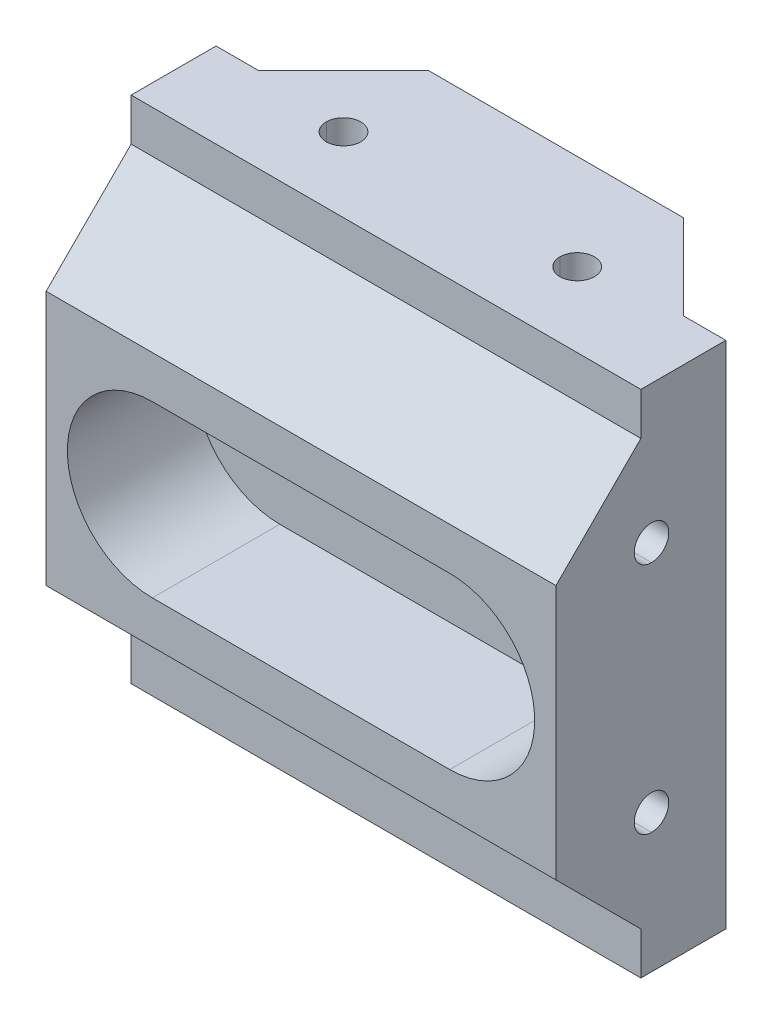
ISO-10303-21;
HEADER;
FILE_DESCRIPTION(('STEP AP214'),'2;1');
FILE_NAME('part.step','',(''),(''),'','','');
FILE_SCHEMA(('AUTOMOTIVE_DESIGN { 1 0 10303 214 1 1 1 1 }'));
ENDSEC;
DATA;
#1=APPLICATION_CONTEXT('core data for automotive mechanical design processes');
#2=APPLICATION_PROTOCOL_DEFINITION('international standard','automotive_design',2000,#1);
#3=PRODUCT_CONTEXT('',#1,'mechanical');
#4=PRODUCT('Part','Part','',(#3));
#5=PRODUCT_RELATED_PRODUCT_CATEGORY('part','',(#4));
#6=PRODUCT_DEFINITION_FORMATION('','',#4);
#7=PRODUCT_DEFINITION_CONTEXT('part definition',#1,'design');
#8=PRODUCT_DEFINITION('design','',#6,#7);
#9=PRODUCT_DEFINITION_SHAPE('','',#8);
#10=(LENGTH_UNIT() NAMED_UNIT(*) SI_UNIT(.MILLI.,.METRE.));
#11=(NAMED_UNIT(*) PLANE_ANGLE_UNIT() SI_UNIT($,.RADIAN.));
#12=(NAMED_UNIT(*) SI_UNIT($,.STERADIAN.) SOLID_ANGLE_UNIT());
#13=UNCERTAINTY_MEASURE_WITH_UNIT(LENGTH_MEASURE(1.E-05),#10,'distance_accuracy_value','');
#14=(GEOMETRIC_REPRESENTATION_CONTEXT(3) GLOBAL_UNCERTAINTY_ASSIGNED_CONTEXT((#13)) GLOBAL_UNIT_ASSIGNED_CONTEXT((#10,
#11,#12)) REPRESENTATION_CONTEXT('',''));
#15=CARTESIAN_POINT('',(0.,0.,0.));
#16=DIRECTION('',(0.,0.,1.));
#17=DIRECTION('',(1.,0.,0.));
#18=AXIS2_PLACEMENT_3D('',#15,#16,#17);
#19=CARTESIAN_POINT('',(0.,0.,-7.21911419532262E-13));
#20=DIRECTION('',(0.,0.,-1.));
#21=DIRECTION('',(-1.,0.,0.));
#22=AXIS2_PLACEMENT_3D('',#19,#20,#21);
#23=PLANE('',#22);
#24=DIRECTION('',(1.,0.,0.));
#25=VECTOR('',#24,1.);
#26=CARTESIAN_POINT('',(-22.225,12.7,-7.21911419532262E-13));
#27=LINE('',#26,#25);
#28=CARTESIAN_POINT('',(22.225,12.7,-7.21911419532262E-13));
#29=VERTEX_POINT('',#28);
#30=CARTESIAN_POINT('',(-22.225,12.7,-7.21911419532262E-13));
#31=VERTEX_POINT('',#30);
#32=EDGE_CURVE('E174',#29,#31,#27,.F.);
#33=ORIENTED_EDGE('',*,*,#32,.T.);
#34=CARTESIAN_POINT('',(-22.225,0.,-7.21911419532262E-13));
#35=DIRECTION('',(0.,0.,1.));
#36=DIRECTION('',(1.,0.,0.));
#37=AXIS2_PLACEMENT_3D('',#34,#35,#36);
#38=CIRCLE('',#37,12.7);
#39=CARTESIAN_POINT('',(-22.225,-12.6999999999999,-7.21911419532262E-13));
#40=VERTEX_POINT('',#39);
#41=EDGE_CURVE('E19',#31,#40,#38,.T.);
#42=ORIENTED_EDGE('',*,*,#41,.T.);
#43=DIRECTION('',(1.,0.,0.));
#44=VECTOR('',#43,1.);
#45=CARTESIAN_POINT('',(22.225,-12.7,-7.21911419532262E-13));
#46=LINE('',#45,#44);
#47=CARTESIAN_POINT('',(22.225,-12.7,-7.21911419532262E-13));
#48=VERTEX_POINT('',#47);
#49=EDGE_CURVE('E177',#40,#48,#46,.T.);
#50=ORIENTED_EDGE('',*,*,#49,.T.);
#51=CARTESIAN_POINT('',(22.225,0.,-7.21911419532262E-13));
#52=DIRECTION('',(0.,0.,1.));
#53=DIRECTION('',(1.,0.,0.));
#54=AXIS2_PLACEMENT_3D('',#51,#52,#53);
#55=CIRCLE('',#54,12.7);
#56=EDGE_CURVE('E258',#48,#29,#55,.T.);
#57=ORIENTED_EDGE('',*,*,#56,.T.);
#58=EDGE_LOOP('',(#33,#42,#50,#57));
#59=FACE_BOUND('',#58,.T.);
#60=ADVANCED_FACE('F16',(#59),#23,.F.);
#61=CARTESIAN_POINT('',(25.4,-17.4624999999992,4.76250000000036));
#62=DIRECTION('',(-1.,0.,0.));
#63=DIRECTION('',(0.,0.,1.));
#64=AXIS2_PLACEMENT_3D('',#61,#62,#63);
#65=PLANE('',#64);
#66=CARTESIAN_POINT('',(25.4,-17.4624999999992,4.76250000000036));
#67=DIRECTION('',(1.,0.,0.));
#68=DIRECTION('',(0.,0.,-1.));
#69=AXIS2_PLACEMENT_3D('',#66,#67,#68);
#70=CIRCLE('',#69,2.5796875);
#71=CARTESIAN_POINT('',(25.4,-14.8828124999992,4.76250000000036));
#72=VERTEX_POINT('',#71);
#73=CARTESIAN_POINT('',(25.4,-20.0421874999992,4.76250000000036));
#74=VERTEX_POINT('',#73);
#75=EDGE_CURVE('E253',#72,#74,#70,.T.);
#76=ORIENTED_EDGE('',*,*,#75,.T.);
#77=CARTESIAN_POINT('',(25.4,-17.4624999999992,4.76250000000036));
#78=DIRECTION('',(1.,0.,0.));
#79=DIRECTION('',(0.,0.,-1.));
#80=AXIS2_PLACEMENT_3D('',#77,#78,#79);
#81=CIRCLE('',#80,2.5796875);
#82=EDGE_CURVE('E256',#74,#72,#81,.T.);
#83=ORIENTED_EDGE('',*,*,#82,.T.);
#84=EDGE_LOOP('',(#76,#83));
#85=FACE_BOUND('',#84,.T.);
#86=ADVANCED_FACE('F495',(#85),#65,.F.);
#87=CARTESIAN_POINT('',(25.4,17.4625000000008,4.76250000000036));
#88=DIRECTION('',(-1.,0.,0.));
#89=DIRECTION('',(0.,0.,1.));
#90=AXIS2_PLACEMENT_3D('',#87,#88,#89);
#91=PLANE('',#90);
#92=CARTESIAN_POINT('',(25.4,17.4625000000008,4.76250000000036));
#93=DIRECTION('',(-1.,0.,0.));
#94=DIRECTION('',(0.,0.,1.));
#95=AXIS2_PLACEMENT_3D('',#92,#93,#94);
#96=CIRCLE('',#95,2.5796875);
#97=CARTESIAN_POINT('',(25.4,20.0421875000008,4.76250000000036));
#98=VERTEX_POINT('',#97);
#99=CARTESIAN_POINT('',(25.4,14.8828125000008,4.76250000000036));
#100=VERTEX_POINT('',#99);
#101=EDGE_CURVE('E250',#98,#100,#96,.F.);
#102=ORIENTED_EDGE('',*,*,#101,.T.);
#103=CARTESIAN_POINT('',(25.4,17.4625000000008,4.76250000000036));
#104=DIRECTION('',(-1.,0.,0.));
#105=DIRECTION('',(0.,0.,1.));
#106=AXIS2_PLACEMENT_3D('',#103,#104,#105);
#107=CIRCLE('',#106,2.5796875);
#108=EDGE_CURVE('E247',#100,#98,#107,.F.);
#109=ORIENTED_EDGE('',*,*,#108,.T.);
#110=EDGE_LOOP('',(#102,#109));
#111=FACE_BOUND('',#110,.T.);
#112=ADVANCED_FACE('F493',(#111),#91,.F.);
#113=CARTESIAN_POINT('',(22.225,-12.7,-7.21911419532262E-13));
#114=DIRECTION('',(0.,-1.,0.));
#115=DIRECTION('',(1.,0.,0.));
#116=AXIS2_PLACEMENT_3D('',#113,#114,#115);
#117=PLANE('',#116);
#118=DIRECTION('',(0.,0.,1.));
#119=VECTOR('',#118,1.);
#120=CARTESIAN_POINT('',(22.225,-12.7,-7.21911419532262E-13));
#121=LINE('',#120,#119);
#122=CARTESIAN_POINT('',(22.225,-12.7,19.05));
#123=VERTEX_POINT('',#122);
#124=EDGE_CURVE('E187',#123,#48,#121,.F.);
#125=ORIENTED_EDGE('',*,*,#124,.T.);
#126=ORIENTED_EDGE('',*,*,#49,.F.);
#127=DIRECTION('',(0.,0.,1.));
#128=VECTOR('',#127,1.);
#129=CARTESIAN_POINT('',(-22.225,-12.7,-7.21911419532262E-13));
#130=LINE('',#129,#128);
#131=CARTESIAN_POINT('',(-22.225,-12.7,19.05));
#132=VERTEX_POINT('',#131);
#133=EDGE_CURVE('E182',#40,#132,#130,.T.);
#134=ORIENTED_EDGE('',*,*,#133,.T.);
#135=DIRECTION('',(1.,0.,0.));
#136=VECTOR('',#135,1.);
#137=CARTESIAN_POINT('',(-38.1,-12.7,19.05));
#138=LINE('',#137,#136);
#139=EDGE_CURVE('E246',#123,#132,#138,.F.);
#140=ORIENTED_EDGE('',*,*,#139,.F.);
#141=EDGE_LOOP('',(#125,#126,#134,#140));
#142=FACE_BOUND('',#141,.T.);
#143=ADVANCED_FACE('F184',(#142),#117,.F.);
#144=CARTESIAN_POINT('',(-22.225,0.,-7.21911419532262E-13));
#145=DIRECTION('',(0.,0.,1.));
#146=DIRECTION('',(1.,0.,0.));
#147=AXIS2_PLACEMENT_3D('',#144,#145,#146);
#148=CYLINDRICAL_SURFACE('',#147,12.7);
#149=ORIENTED_EDGE('',*,*,#133,.F.);
#150=ORIENTED_EDGE('',*,*,#41,.F.);
#151=DIRECTION('',(0.,0.,1.));
#152=VECTOR('',#151,1.);
#153=CARTESIAN_POINT('',(-22.225,12.7,-7.21911419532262E-13));
#154=LINE('',#153,#152);
#155=CARTESIAN_POINT('',(-22.225,12.7,19.05));
#156=VERTEX_POINT('',#155);
#157=EDGE_CURVE('E195',#31,#156,#154,.T.);
#158=ORIENTED_EDGE('',*,*,#157,.T.);
#159=CARTESIAN_POINT('',(-22.225,0.,19.05));
#160=DIRECTION('',(0.,0.,1.));
#161=DIRECTION('',(1.,0.,0.));
#162=AXIS2_PLACEMENT_3D('',#159,#160,#161);
#163=CIRCLE('',#162,12.7);
#164=EDGE_CURVE('E192',#132,#156,#163,.F.);
#165=ORIENTED_EDGE('',*,*,#164,.F.);
#166=EDGE_LOOP('',(#149,#150,#158,#165));
#167=FACE_BOUND('',#166,.T.);
#168=ADVANCED_FACE('F190',(#167),#148,.F.);
#169=CARTESIAN_POINT('',(-22.225,12.7,-7.21911419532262E-13));
#170=DIRECTION('',(0.,1.,0.));
#171=DIRECTION('',(0.,0.,1.));
#172=AXIS2_PLACEMENT_3D('',#169,#170,#171);
#173=PLANE('',#172);
#174=ORIENTED_EDGE('',*,*,#157,.F.);
#175=ORIENTED_EDGE('',*,*,#32,.F.);
#176=DIRECTION('',(0.,0.,1.));
#177=VECTOR('',#176,1.);
#178=CARTESIAN_POINT('',(22.225,12.7,-7.21911419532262E-13));
#179=LINE('',#178,#177);
#180=CARTESIAN_POINT('',(22.225,12.7,19.05));
#181=VERTEX_POINT('',#180);
#182=EDGE_CURVE('E257',#29,#181,#179,.T.);
#183=ORIENTED_EDGE('',*,*,#182,.T.);
#184=DIRECTION('',(1.,0.,0.));
#185=VECTOR('',#184,1.);
#186=CARTESIAN_POINT('',(-38.1,12.7,19.05));
#187=LINE('',#186,#185);
#188=EDGE_CURVE('E244',#156,#181,#187,.T.);
#189=ORIENTED_EDGE('',*,*,#188,.F.);
#190=EDGE_LOOP('',(#174,#175,#183,#189));
#191=FACE_BOUND('',#190,.T.);
#192=ADVANCED_FACE('F481',(#191),#173,.F.);
#193=CARTESIAN_POINT('',(22.225,0.,-7.21911419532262E-13));
#194=DIRECTION('',(0.,0.,1.));
#195=DIRECTION('',(1.,0.,0.));
#196=AXIS2_PLACEMENT_3D('',#193,#194,#195);
#197=CYLINDRICAL_SURFACE('',#196,12.7);
#198=ORIENTED_EDGE('',*,*,#182,.F.);
#199=ORIENTED_EDGE('',*,*,#56,.F.);
#200=ORIENTED_EDGE('',*,*,#124,.F.);
#201=CARTESIAN_POINT('',(22.225,0.,19.05));
#202=DIRECTION('',(0.,0.,1.));
#203=DIRECTION('',(1.,0.,0.));
#204=AXIS2_PLACEMENT_3D('',#201,#202,#203);
#205=CIRCLE('',#204,12.7);
#206=EDGE_CURVE('E240',#181,#123,#205,.F.);
#207=ORIENTED_EDGE('',*,*,#206,.F.);
#208=EDGE_LOOP('',(#198,#199,#200,#207));
#209=FACE_BOUND('',#208,.T.);
#210=ADVANCED_FACE('F472',(#209),#197,.F.);
#211=CARTESIAN_POINT('',(17.4625,25.4,-4.76250000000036));
#212=DIRECTION('',(0.,-1.,0.));
#213=DIRECTION('',(0.,0.,-1.));
#214=AXIS2_PLACEMENT_3D('',#211,#212,#213);
#215=PLANE('',#214);
#216=CARTESIAN_POINT('',(17.4625,25.4,-4.76250000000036));
#217=DIRECTION('',(0.,1.,0.));
#218=DIRECTION('',(0.,0.,1.));
#219=AXIS2_PLACEMENT_3D('',#216,#217,#218);
#220=CIRCLE('',#219,2.5796875);
#221=CARTESIAN_POINT('',(14.8828125,25.4,-4.76250000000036));
#222=VERTEX_POINT('',#221);
#223=CARTESIAN_POINT('',(20.0421875,25.4,-4.76250000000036));
#224=VERTEX_POINT('',#223);
#225=EDGE_CURVE('E234',#222,#224,#220,.T.);
#226=ORIENTED_EDGE('',*,*,#225,.T.);
#227=CARTESIAN_POINT('',(17.4625,25.4,-4.76250000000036));
#228=DIRECTION('',(0.,1.,0.));
#229=DIRECTION('',(0.,0.,1.));
#230=AXIS2_PLACEMENT_3D('',#227,#228,#229);
#231=CIRCLE('',#230,2.5796875);
#232=EDGE_CURVE('E237',#224,#222,#231,.T.);
#233=ORIENTED_EDGE('',*,*,#232,.T.);
#234=EDGE_LOOP('',(#226,#233));
#235=FACE_BOUND('',#234,.T.);
#236=ADVANCED_FACE('F469',(#235),#215,.F.);
#237=CARTESIAN_POINT('',(-17.4625,25.4,-4.76250000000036));
#238=DIRECTION('',(0.,-1.,0.));
#239=DIRECTION('',(0.,0.,-1.));
#240=AXIS2_PLACEMENT_3D('',#237,#238,#239);
#241=PLANE('',#240);
#242=CARTESIAN_POINT('',(-17.4625,25.4,-4.76250000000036));
#243=DIRECTION('',(0.,1.,0.));
#244=DIRECTION('',(0.,0.,1.));
#245=AXIS2_PLACEMENT_3D('',#242,#243,#244);
#246=CIRCLE('',#245,2.5796875);
#247=CARTESIAN_POINT('',(-20.0421875,25.4,-4.76250000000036));
#248=VERTEX_POINT('',#247);
#249=CARTESIAN_POINT('',(-14.8828125,25.4,-4.76250000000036));
#250=VERTEX_POINT('',#249);
#251=EDGE_CURVE('E228',#248,#250,#246,.T.);
#252=ORIENTED_EDGE('',*,*,#251,.T.);
#253=CARTESIAN_POINT('',(-17.4625,25.4,-4.76250000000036));
#254=DIRECTION('',(0.,1.,0.));
#255=DIRECTION('',(0.,0.,1.));
#256=AXIS2_PLACEMENT_3D('',#253,#254,#255);
#257=CIRCLE('',#256,2.5796875);
#258=EDGE_CURVE('E231',#250,#248,#257,.T.);
#259=ORIENTED_EDGE('',*,*,#258,.T.);
#260=EDGE_LOOP('',(#252,#259));
#261=FACE_BOUND('',#260,.T.);
#262=ADVANCED_FACE('F471',(#261),#241,.F.);
#263=CARTESIAN_POINT('',(31.75,-17.4624999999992,4.76250000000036));
#264=DIRECTION('',(1.,0.,0.));
#265=DIRECTION('',(0.,0.,-1.));
#266=AXIS2_PLACEMENT_3D('',#263,#264,#265);
#267=CYLINDRICAL_SURFACE('',#266,2.5796875);
#268=ORIENTED_EDGE('',*,*,#82,.F.);
#269=DIRECTION('',(1.,0.,0.));
#270=VECTOR('',#269,1.);
#271=CARTESIAN_POINT('',(31.75,-20.0421874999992,4.76250000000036));
#272=LINE('',#271,#270);
#273=CARTESIAN_POINT('',(38.1,-20.0421874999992,4.76250000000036));
#274=VERTEX_POINT('',#273);
#275=EDGE_CURVE('E255',#74,#274,#272,.T.);
#276=ORIENTED_EDGE('',*,*,#275,.T.);
#277=CARTESIAN_POINT('',(38.1,-17.4624999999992,4.76250000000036));
#278=DIRECTION('',(1.,0.,0.));
#279=DIRECTION('',(0.,0.,-1.));
#280=AXIS2_PLACEMENT_3D('',#277,#278,#279);
#281=CIRCLE('',#280,2.5796875);
#282=CARTESIAN_POINT('',(38.1,-14.8828124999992,4.76250000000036));
#283=VERTEX_POINT('',#282);
#284=EDGE_CURVE('E224',#283,#274,#281,.F.);
#285=ORIENTED_EDGE('',*,*,#284,.F.);
#286=DIRECTION('',(1.,0.,0.));
#287=VECTOR('',#286,1.);
#288=CARTESIAN_POINT('',(31.75,-14.8828124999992,4.76250000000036));
#289=LINE('',#288,#287);
#290=EDGE_CURVE('E252',#283,#72,#289,.F.);
#291=ORIENTED_EDGE('',*,*,#290,.T.);
#292=EDGE_LOOP('',(#268,#276,#285,#291));
#293=FACE_BOUND('',#292,.T.);
#294=ADVANCED_FACE('F478',(#293),#267,.F.);
#295=CARTESIAN_POINT('',(31.75,-17.4624999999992,4.76250000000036));
#296=DIRECTION('',(1.,0.,0.));
#297=DIRECTION('',(0.,0.,-1.));
#298=AXIS2_PLACEMENT_3D('',#295,#296,#297);
#299=CYLINDRICAL_SURFACE('',#298,2.5796875);
#300=CARTESIAN_POINT('',(38.1,-17.4624999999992,4.76250000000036));
#301=DIRECTION('',(1.,0.,0.));
#302=DIRECTION('',(0.,0.,-1.));
#303=AXIS2_PLACEMENT_3D('',#300,#301,#302);
#304=CIRCLE('',#303,2.5796875);
#305=EDGE_CURVE('E221',#274,#283,#304,.F.);
#306=ORIENTED_EDGE('',*,*,#305,.F.);
#307=ORIENTED_EDGE('',*,*,#275,.F.);
#308=ORIENTED_EDGE('',*,*,#75,.F.);
#309=ORIENTED_EDGE('',*,*,#290,.F.);
#310=EDGE_LOOP('',(#306,#307,#308,#309));
#311=FACE_BOUND('',#310,.T.);
#312=ADVANCED_FACE('F509',(#311),#299,.F.);
#313=CARTESIAN_POINT('',(31.75,17.4625000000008,4.76250000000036));
#314=DIRECTION('',(-1.,0.,0.));
#315=DIRECTION('',(0.,0.,1.));
#316=AXIS2_PLACEMENT_3D('',#313,#314,#315);
#317=CYLINDRICAL_SURFACE('',#316,2.5796875);
#318=ORIENTED_EDGE('',*,*,#101,.F.);
#319=DIRECTION('',(-1.,0.,0.));
#320=VECTOR('',#319,1.);
#321=CARTESIAN_POINT('',(31.75,20.0421875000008,4.76250000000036));
#322=LINE('',#321,#320);
#323=CARTESIAN_POINT('',(38.1,20.0421875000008,4.76250000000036));
#324=VERTEX_POINT('',#323);
#325=EDGE_CURVE('E249',#98,#324,#322,.F.);
#326=ORIENTED_EDGE('',*,*,#325,.T.);
#327=CARTESIAN_POINT('',(38.1,17.4625000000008,4.76250000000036));
#328=DIRECTION('',(-1.,0.,0.));
#329=DIRECTION('',(0.,0.,1.));
#330=AXIS2_PLACEMENT_3D('',#327,#328,#329);
#331=CIRCLE('',#330,2.5796875);
#332=CARTESIAN_POINT('',(38.1,14.8828125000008,4.76250000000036));
#333=VERTEX_POINT('',#332);
#334=EDGE_CURVE('E218',#333,#324,#331,.T.);
#335=ORIENTED_EDGE('',*,*,#334,.F.);
#336=DIRECTION('',(-1.,0.,0.));
#337=VECTOR('',#336,1.);
#338=CARTESIAN_POINT('',(31.75,14.8828125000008,4.76250000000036));
#339=LINE('',#338,#337);
#340=EDGE_CURVE('E264',#333,#100,#339,.T.);
#341=ORIENTED_EDGE('',*,*,#340,.T.);
#342=EDGE_LOOP('',(#318,#326,#335,#341));
#343=FACE_BOUND('',#342,.T.);
#344=ADVANCED_FACE('F512',(#343),#317,.F.);
#345=CARTESIAN_POINT('',(31.75,17.4625000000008,4.76250000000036));
#346=DIRECTION('',(-1.,0.,0.));
#347=DIRECTION('',(0.,0.,1.));
#348=AXIS2_PLACEMENT_3D('',#345,#346,#347);
#349=CYLINDRICAL_SURFACE('',#348,2.5796875);
#350=CARTESIAN_POINT('',(38.1,17.4625000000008,4.76250000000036));
#351=DIRECTION('',(-1.,0.,0.));
#352=DIRECTION('',(0.,0.,1.));
#353=AXIS2_PLACEMENT_3D('',#350,#351,#352);
#354=CIRCLE('',#353,2.5796875);
#355=EDGE_CURVE('E214',#324,#333,#354,.T.);
#356=ORIENTED_EDGE('',*,*,#355,.F.);
#357=ORIENTED_EDGE('',*,*,#325,.F.);
#358=ORIENTED_EDGE('',*,*,#108,.F.);
#359=ORIENTED_EDGE('',*,*,#340,.F.);
#360=EDGE_LOOP('',(#356,#357,#358,#359));
#361=FACE_BOUND('',#360,.T.);
#362=ADVANCED_FACE('F518',(#361),#349,.F.);
#363=CARTESIAN_POINT('',(-38.1,19.05,19.05));
#364=DIRECTION('',(0.,0.707106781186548,0.707106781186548));
#365=DIRECTION('',(0.,-0.707106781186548,0.707106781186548));
#366=AXIS2_PLACEMENT_3D('',#363,#364,#365);
#367=PLANE('',#366);
#368=DIRECTION('',(0.,-0.707106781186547,0.707106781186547));
#369=VECTOR('',#368,1.);
#370=CARTESIAN_POINT('',(-38.1,31.75,6.35));
#371=LINE('',#370,#369);
#372=CARTESIAN_POINT('',(-38.1,31.75,6.35000000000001));
#373=VERTEX_POINT('',#372);
#374=CARTESIAN_POINT('',(-38.1,19.05,19.05));
#375=VERTEX_POINT('',#374);
#376=EDGE_CURVE('E287',#373,#375,#371,.T.);
#377=ORIENTED_EDGE('',*,*,#376,.T.);
#378=DIRECTION('',(1.,0.,0.));
#379=VECTOR('',#378,1.);
#380=CARTESIAN_POINT('',(-38.1,19.05,19.05));
#381=LINE('',#380,#379);
#382=CARTESIAN_POINT('',(38.1,19.05,19.05));
#383=VERTEX_POINT('',#382);
#384=EDGE_CURVE('E243',#383,#375,#381,.F.);
#385=ORIENTED_EDGE('',*,*,#384,.F.);
#386=DIRECTION('',(0.,-0.707106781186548,0.707106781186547));
#387=VECTOR('',#386,1.);
#388=CARTESIAN_POINT('',(38.1,31.75,6.35));
#389=LINE('',#388,#387);
#390=CARTESIAN_POINT('',(38.1,31.75,6.35000000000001));
#391=VERTEX_POINT('',#390);
#392=EDGE_CURVE('E303',#391,#383,#389,.T.);
#393=ORIENTED_EDGE('',*,*,#392,.F.);
#394=DIRECTION('',(1.,0.,0.));
#395=VECTOR('',#394,1.);
#396=CARTESIAN_POINT('',(-38.1,31.75,6.35));
#397=LINE('',#396,#395);
#398=EDGE_CURVE('E281',#373,#391,#397,.T.);
#399=ORIENTED_EDGE('',*,*,#398,.F.);
#400=EDGE_LOOP('',(#377,#385,#393,#399));
#401=FACE_BOUND('',#400,.T.);
#402=ADVANCED_FACE('F406',(#401),#367,.T.);
#403=CARTESIAN_POINT('',(-38.1,-19.05,19.05));
#404=DIRECTION('',(0.,0.,1.));
#405=DIRECTION('',(1.,0.,0.));
#406=AXIS2_PLACEMENT_3D('',#403,#404,#405);
#407=PLANE('',#406);
#408=DIRECTION('',(0.,1.,0.));
#409=VECTOR('',#408,1.);
#410=CARTESIAN_POINT('',(-38.1,0.,19.05));
#411=LINE('',#410,#409);
#412=CARTESIAN_POINT('',(-38.1,-19.05,19.05));
#413=VERTEX_POINT('',#412);
#414=EDGE_CURVE('E289',#375,#413,#411,.F.);
#415=ORIENTED_EDGE('',*,*,#414,.T.);
#416=DIRECTION('',(1.,0.,0.));
#417=VECTOR('',#416,1.);
#418=CARTESIAN_POINT('',(-38.1,-19.05,19.05));
#419=LINE('',#418,#417);
#420=CARTESIAN_POINT('',(38.1,-19.05,19.05));
#421=VERTEX_POINT('',#420);
#422=EDGE_CURVE('E239',#421,#413,#419,.F.);
#423=ORIENTED_EDGE('',*,*,#422,.F.);
#424=DIRECTION('',(0.,1.,0.));
#425=VECTOR('',#424,1.);
#426=CARTESIAN_POINT('',(38.1,-38.1,19.05));
#427=LINE('',#426,#425);
#428=EDGE_CURVE('E306',#383,#421,#427,.F.);
#429=ORIENTED_EDGE('',*,*,#428,.F.);
#430=ORIENTED_EDGE('',*,*,#384,.T.);
#431=EDGE_LOOP('',(#415,#423,#429,#430));
#432=FACE_BOUND('',#431,.T.);
#433=ORIENTED_EDGE('',*,*,#188,.T.);
#434=ORIENTED_EDGE('',*,*,#206,.T.);
#435=ORIENTED_EDGE('',*,*,#139,.T.);
#436=ORIENTED_EDGE('',*,*,#164,.T.);
#437=EDGE_LOOP('',(#433,#434,#435,#436));
#438=FACE_BOUND('',#437,.T.);
#439=ADVANCED_FACE('F408',(#432,#438),#407,.T.);
#440=CARTESIAN_POINT('',(-38.1,-31.75,6.35));
#441=DIRECTION('',(0.,-0.707106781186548,0.707106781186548));
#442=DIRECTION('',(0.,-0.707106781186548,-0.707106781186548));
#443=AXIS2_PLACEMENT_3D('',#440,#441,#442);
#444=PLANE('',#443);
#445=DIRECTION('',(0.,-0.707106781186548,-0.707106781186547));
#446=VECTOR('',#445,1.);
#447=CARTESIAN_POINT('',(-38.1,-19.05,19.05));
#448=LINE('',#447,#446);
#449=CARTESIAN_POINT('',(-38.1,-31.75,6.35));
#450=VERTEX_POINT('',#449);
#451=EDGE_CURVE('E291',#413,#450,#448,.T.);
#452=ORIENTED_EDGE('',*,*,#451,.T.);
#453=DIRECTION('',(1.,0.,0.));
#454=VECTOR('',#453,1.);
#455=CARTESIAN_POINT('',(-38.1,-31.75,6.35));
#456=LINE('',#455,#454);
#457=CARTESIAN_POINT('',(38.1,-31.75,6.35));
#458=VERTEX_POINT('',#457);
#459=EDGE_CURVE('E293',#458,#450,#456,.F.);
#460=ORIENTED_EDGE('',*,*,#459,.F.);
#461=DIRECTION('',(0.,-0.707106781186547,-0.707106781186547));
#462=VECTOR('',#461,1.);
#463=CARTESIAN_POINT('',(38.1,-19.05,19.05));
#464=LINE('',#463,#462);
#465=EDGE_CURVE('E309',#421,#458,#464,.T.);
#466=ORIENTED_EDGE('',*,*,#465,.F.);
#467=ORIENTED_EDGE('',*,*,#422,.T.);
#468=EDGE_LOOP('',(#452,#460,#466,#467));
#469=FACE_BOUND('',#468,.T.);
#470=ADVANCED_FACE('F412',(#469),#444,.T.);
#471=CARTESIAN_POINT('',(17.4625,31.75,-4.76250000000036));
#472=DIRECTION('',(0.,1.,0.));
#473=DIRECTION('',(0.,0.,1.));
#474=AXIS2_PLACEMENT_3D('',#471,#472,#473);
#475=CYLINDRICAL_SURFACE('',#474,2.5796875);
#476=ORIENTED_EDGE('',*,*,#232,.F.);
#477=DIRECTION('',(0.,1.,0.));
#478=VECTOR('',#477,1.);
#479=CARTESIAN_POINT('',(20.0421875,31.75,-4.76250000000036));
#480=LINE('',#479,#478);
#481=CARTESIAN_POINT('',(20.0421875,38.1,-4.76250000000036));
#482=VERTEX_POINT('',#481);
#483=EDGE_CURVE('E236',#224,#482,#480,.T.);
#484=ORIENTED_EDGE('',*,*,#483,.T.);
#485=CARTESIAN_POINT('',(17.4625,38.1,-4.76250000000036));
#486=DIRECTION('',(0.,1.,0.));
#487=DIRECTION('',(0.,0.,1.));
#488=AXIS2_PLACEMENT_3D('',#485,#486,#487);
#489=CIRCLE('',#488,2.5796875);
#490=CARTESIAN_POINT('',(14.8828125,38.1,-4.76250000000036));
#491=VERTEX_POINT('',#490);
#492=EDGE_CURVE('E210',#491,#482,#489,.F.);
#493=ORIENTED_EDGE('',*,*,#492,.F.);
#494=DIRECTION('',(0.,1.,0.));
#495=VECTOR('',#494,1.);
#496=CARTESIAN_POINT('',(14.8828125,31.75,-4.76250000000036));
#497=LINE('',#496,#495);
#498=EDGE_CURVE('E233',#491,#222,#497,.F.);
#499=ORIENTED_EDGE('',*,*,#498,.T.);
#500=EDGE_LOOP('',(#476,#484,#493,#499));
#501=FACE_BOUND('',#500,.T.);
#502=ADVANCED_FACE('F414',(#501),#475,.F.);
#503=CARTESIAN_POINT('',(17.4625,31.75,-4.76250000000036));
#504=DIRECTION('',(0.,1.,0.));
#505=DIRECTION('',(0.,0.,1.));
#506=AXIS2_PLACEMENT_3D('',#503,#504,#505);
#507=CYLINDRICAL_SURFACE('',#506,2.5796875);
#508=CARTESIAN_POINT('',(17.4625,38.1,-4.76250000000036));
#509=DIRECTION('',(0.,1.,0.));
#510=DIRECTION('',(0.,0.,1.));
#511=AXIS2_PLACEMENT_3D('',#508,#509,#510);
#512=CIRCLE('',#511,2.5796875);
#513=EDGE_CURVE('E207',#482,#491,#512,.F.);
#514=ORIENTED_EDGE('',*,*,#513,.F.);
#515=ORIENTED_EDGE('',*,*,#483,.F.);
#516=ORIENTED_EDGE('',*,*,#225,.F.);
#517=ORIENTED_EDGE('',*,*,#498,.F.);
#518=EDGE_LOOP('',(#514,#515,#516,#517));
#519=FACE_BOUND('',#518,.T.);
#520=ADVANCED_FACE('F421',(#519),#507,.F.);
#521=CARTESIAN_POINT('',(-17.4625,31.75,-4.76250000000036));
#522=DIRECTION('',(0.,1.,0.));
#523=DIRECTION('',(0.,0.,1.));
#524=AXIS2_PLACEMENT_3D('',#521,#522,#523);
#525=CYLINDRICAL_SURFACE('',#524,2.5796875);
#526=ORIENTED_EDGE('',*,*,#258,.F.);
#527=DIRECTION('',(0.,1.,0.));
#528=VECTOR('',#527,1.);
#529=CARTESIAN_POINT('',(-14.8828125,31.75,-4.76250000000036));
#530=LINE('',#529,#528);
#531=CARTESIAN_POINT('',(-14.8828125,38.1,-4.76250000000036));
#532=VERTEX_POINT('',#531);
#533=EDGE_CURVE('E230',#250,#532,#530,.T.);
#534=ORIENTED_EDGE('',*,*,#533,.T.);
#535=CARTESIAN_POINT('',(-17.4625,38.1,-4.76250000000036));
#536=DIRECTION('',(0.,1.,0.));
#537=DIRECTION('',(0.,0.,1.));
#538=AXIS2_PLACEMENT_3D('',#535,#536,#537);
#539=CIRCLE('',#538,2.5796875);
#540=CARTESIAN_POINT('',(-20.0421875,38.1,-4.76250000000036));
#541=VERTEX_POINT('',#540);
#542=EDGE_CURVE('E204',#541,#532,#539,.F.);
#543=ORIENTED_EDGE('',*,*,#542,.F.);
#544=DIRECTION('',(0.,1.,0.));
#545=VECTOR('',#544,1.);
#546=CARTESIAN_POINT('',(-20.0421875,31.75,-4.76250000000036));
#547=LINE('',#546,#545);
#548=EDGE_CURVE('E278',#541,#248,#547,.F.);
#549=ORIENTED_EDGE('',*,*,#548,.T.);
#550=EDGE_LOOP('',(#526,#534,#543,#549));
#551=FACE_BOUND('',#550,.T.);
#552=ADVANCED_FACE('F453',(#551),#525,.F.);
#553=CARTESIAN_POINT('',(-17.4625,31.75,-4.76250000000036));
#554=DIRECTION('',(0.,1.,0.));
#555=DIRECTION('',(0.,0.,1.));
#556=AXIS2_PLACEMENT_3D('',#553,#554,#555);
#557=CYLINDRICAL_SURFACE('',#556,2.5796875);
#558=CARTESIAN_POINT('',(-17.4625,38.1,-4.76250000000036));
#559=DIRECTION('',(0.,1.,0.));
#560=DIRECTION('',(0.,0.,1.));
#561=AXIS2_PLACEMENT_3D('',#558,#559,#560);
#562=CIRCLE('',#561,2.5796875);
#563=EDGE_CURVE('E200',#532,#541,#562,.F.);
#564=ORIENTED_EDGE('',*,*,#563,.F.);
#565=ORIENTED_EDGE('',*,*,#533,.F.);
#566=ORIENTED_EDGE('',*,*,#251,.F.);
#567=ORIENTED_EDGE('',*,*,#548,.F.);
#568=EDGE_LOOP('',(#564,#565,#566,#567));
#569=FACE_BOUND('',#568,.T.);
#570=ADVANCED_FACE('F450',(#569),#557,.F.);
#571=CARTESIAN_POINT('',(-38.1,31.75,6.35));
#572=DIRECTION('',(0.,0.,1.));
#573=DIRECTION('',(1.,0.,0.));
#574=AXIS2_PLACEMENT_3D('',#571,#572,#573);
#575=PLANE('',#574);
#576=DIRECTION('',(0.,1.,0.));
#577=VECTOR('',#576,1.);
#578=CARTESIAN_POINT('',(-38.1,0.,6.35));
#579=LINE('',#578,#577);
#580=CARTESIAN_POINT('',(-38.1,38.1,6.35));
#581=VERTEX_POINT('',#580);
#582=EDGE_CURVE('E284',#581,#373,#579,.F.);
#583=ORIENTED_EDGE('',*,*,#582,.T.);
#584=ORIENTED_EDGE('',*,*,#398,.T.);
#585=DIRECTION('',(0.,1.,0.));
#586=VECTOR('',#585,1.);
#587=CARTESIAN_POINT('',(38.1,-38.1,6.35));
#588=LINE('',#587,#586);
#589=CARTESIAN_POINT('',(38.1,38.1,6.35));
#590=VERTEX_POINT('',#589);
#591=EDGE_CURVE('E300',#590,#391,#588,.F.);
#592=ORIENTED_EDGE('',*,*,#591,.F.);
#593=DIRECTION('',(1.,0.,0.));
#594=VECTOR('',#593,1.);
#595=CARTESIAN_POINT('',(-31.75,38.1,6.35));
#596=LINE('',#595,#594);
#597=EDGE_CURVE('E321',#581,#590,#596,.T.);
#598=ORIENTED_EDGE('',*,*,#597,.F.);
#599=EDGE_LOOP('',(#583,#584,#592,#598));
#600=FACE_BOUND('',#599,.T.);
#601=ADVANCED_FACE('F401',(#600),#575,.T.);
#602=CARTESIAN_POINT('',(-38.1,0.,6.35));
#603=DIRECTION('',(1.,0.,0.));
#604=DIRECTION('',(0.,1.,0.));
#605=AXIS2_PLACEMENT_3D('',#602,#603,#604);
#606=PLANE('',#605);
#607=DIRECTION('',(0.,1.,0.));
#608=VECTOR('',#607,1.);
#609=CARTESIAN_POINT('',(-38.1,-38.1,6.35));
#610=LINE('',#609,#608);
#611=CARTESIAN_POINT('',(-38.1,-38.1,6.35));
#612=VERTEX_POINT('',#611);
#613=EDGE_CURVE('E227',#450,#612,#610,.F.);
#614=ORIENTED_EDGE('',*,*,#613,.F.);
#615=ORIENTED_EDGE('',*,*,#451,.F.);
#616=ORIENTED_EDGE('',*,*,#414,.F.);
#617=ORIENTED_EDGE('',*,*,#376,.F.);
#618=ORIENTED_EDGE('',*,*,#582,.F.);
#619=DIRECTION('',(0.,0.,1.));
#620=VECTOR('',#619,1.);
#621=CARTESIAN_POINT('',(-38.1,38.1,-6.35));
#622=LINE('',#621,#620);
#623=CARTESIAN_POINT('',(-38.1,38.1,-6.35));
#624=VERTEX_POINT('',#623);
#625=EDGE_CURVE('E318',#624,#581,#622,.T.);
#626=ORIENTED_EDGE('',*,*,#625,.F.);
#627=DIRECTION('',(0.,1.,0.));
#628=VECTOR('',#627,1.);
#629=CARTESIAN_POINT('',(-38.1,38.1,-6.35));
#630=LINE('',#629,#628);
#631=CARTESIAN_POINT('',(-38.1,-38.1,-6.35));
#632=VERTEX_POINT('',#631);
#633=EDGE_CURVE('E213',#632,#624,#630,.T.);
#634=ORIENTED_EDGE('',*,*,#633,.F.);
#635=DIRECTION('',(0.,0.,1.));
#636=VECTOR('',#635,1.);
#637=CARTESIAN_POINT('',(-38.1,-38.1,-12.7));
#638=LINE('',#637,#636);
#639=EDGE_CURVE('E338',#632,#612,#638,.T.);
#640=ORIENTED_EDGE('',*,*,#639,.T.);
#641=EDGE_LOOP('',(#614,#615,#616,#617,#618,#626,#634,#640));
#642=FACE_BOUND('',#641,.T.);
#643=ADVANCED_FACE('F387',(#642),#606,.F.);
#644=CARTESIAN_POINT('',(-38.1,-38.1,6.35));
#645=DIRECTION('',(0.,0.,1.));
#646=DIRECTION('',(1.,0.,0.));
#647=AXIS2_PLACEMENT_3D('',#644,#645,#646);
#648=PLANE('',#647);
#649=ORIENTED_EDGE('',*,*,#613,.T.);
#650=DIRECTION('',(1.,0.,0.));
#651=VECTOR('',#650,1.);
#652=CARTESIAN_POINT('',(0.,-38.1,6.35));
#653=LINE('',#652,#651);
#654=CARTESIAN_POINT('',(38.1,-38.1,6.35));
#655=VERTEX_POINT('',#654);
#656=EDGE_CURVE('E340',#612,#655,#653,.T.);
#657=ORIENTED_EDGE('',*,*,#656,.T.);
#658=DIRECTION('',(0.,1.,0.));
#659=VECTOR('',#658,1.);
#660=CARTESIAN_POINT('',(38.1,-38.1,6.35));
#661=LINE('',#660,#659);
#662=EDGE_CURVE('E217',#458,#655,#661,.F.);
#663=ORIENTED_EDGE('',*,*,#662,.F.);
#664=ORIENTED_EDGE('',*,*,#459,.T.);
#665=EDGE_LOOP('',(#649,#657,#663,#664));
#666=FACE_BOUND('',#665,.T.);
#667=ADVANCED_FACE('F383',(#666),#648,.T.);
#668=CARTESIAN_POINT('',(38.1,-38.1,6.35));
#669=DIRECTION('',(1.,0.,0.));
#670=DIRECTION('',(0.,1.,0.));
#671=AXIS2_PLACEMENT_3D('',#668,#669,#670);
#672=PLANE('',#671);
#673=ORIENTED_EDGE('',*,*,#428,.T.);
#674=ORIENTED_EDGE('',*,*,#465,.T.);
#675=ORIENTED_EDGE('',*,*,#662,.T.);
#676=DIRECTION('',(0.,0.,1.));
#677=VECTOR('',#676,1.);
#678=CARTESIAN_POINT('',(38.1,-38.1,-12.7));
#679=LINE('',#678,#677);
#680=CARTESIAN_POINT('',(38.1,-38.1,-6.35));
#681=VERTEX_POINT('',#680);
#682=EDGE_CURVE('E342',#655,#681,#679,.F.);
#683=ORIENTED_EDGE('',*,*,#682,.T.);
#684=DIRECTION('',(0.,1.,0.));
#685=VECTOR('',#684,1.);
#686=CARTESIAN_POINT('',(38.1,38.1,-6.35));
#687=LINE('',#686,#685);
#688=CARTESIAN_POINT('',(38.1,38.1,-6.35));
#689=VERTEX_POINT('',#688);
#690=EDGE_CURVE('E312',#689,#681,#687,.F.);
#691=ORIENTED_EDGE('',*,*,#690,.F.);
#692=DIRECTION('',(0.,0.,1.));
#693=VECTOR('',#692,1.);
#694=CARTESIAN_POINT('',(38.1,38.1,-6.35));
#695=LINE('',#694,#693);
#696=EDGE_CURVE('E324',#590,#689,#695,.F.);
#697=ORIENTED_EDGE('',*,*,#696,.F.);
#698=ORIENTED_EDGE('',*,*,#591,.T.);
#699=ORIENTED_EDGE('',*,*,#392,.T.);
#700=EDGE_LOOP('',(#673,#674,#675,#683,#691,#697,#698,#699));
#701=FACE_BOUND('',#700,.T.);
#702=ORIENTED_EDGE('',*,*,#334,.T.);
#703=ORIENTED_EDGE('',*,*,#355,.T.);
#704=EDGE_LOOP('',(#702,#703));
#705=FACE_BOUND('',#704,.T.);
#706=ORIENTED_EDGE('',*,*,#284,.T.);
#707=ORIENTED_EDGE('',*,*,#305,.T.);
#708=EDGE_LOOP('',(#706,#707));
#709=FACE_BOUND('',#708,.T.);
#710=ADVANCED_FACE('F377',(#701,#705,#709),#672,.T.);
#711=CARTESIAN_POINT('',(-38.1,38.1,-6.35));
#712=DIRECTION('',(0.,0.,-1.));
#713=DIRECTION('',(-1.,0.,0.));
#714=AXIS2_PLACEMENT_3D('',#711,#712,#713);
#715=PLANE('',#714);
#716=ORIENTED_EDGE('',*,*,#690,.T.);
#717=DIRECTION('',(1.,0.,0.));
#718=VECTOR('',#717,1.);
#719=CARTESIAN_POINT('',(0.,-38.1,-6.35));
#720=LINE('',#719,#718);
#721=CARTESIAN_POINT('',(31.75,-38.1,-6.35));
#722=VERTEX_POINT('',#721);
#723=EDGE_CURVE('E344',#681,#722,#720,.F.);
#724=ORIENTED_EDGE('',*,*,#723,.T.);
#725=DIRECTION('',(0.,1.,0.));
#726=VECTOR('',#725,1.);
#727=CARTESIAN_POINT('',(31.75,-38.1,-6.35));
#728=LINE('',#727,#726);
#729=CARTESIAN_POINT('',(31.75,38.1000000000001,-6.35));
#730=VERTEX_POINT('',#729);
#731=EDGE_CURVE('E332',#730,#722,#728,.F.);
#732=ORIENTED_EDGE('',*,*,#731,.F.);
#733=DIRECTION('',(1.,0.,0.));
#734=VECTOR('',#733,1.);
#735=CARTESIAN_POINT('',(-31.75,38.1,-6.35));
#736=LINE('',#735,#734);
#737=EDGE_CURVE('E327',#689,#730,#736,.F.);
#738=ORIENTED_EDGE('',*,*,#737,.F.);
#739=EDGE_LOOP('',(#716,#724,#732,#738));
#740=FACE_BOUND('',#739,.T.);
#741=ADVANCED_FACE('F374',(#740),#715,.T.);
#742=CARTESIAN_POINT('',(-38.1,38.1,-6.35));
#743=DIRECTION('',(0.,0.,-1.));
#744=DIRECTION('',(-1.,0.,0.));
#745=AXIS2_PLACEMENT_3D('',#742,#743,#744);
#746=PLANE('',#745);
#747=ORIENTED_EDGE('',*,*,#633,.T.);
#748=DIRECTION('',(1.,0.,0.));
#749=VECTOR('',#748,1.);
#750=CARTESIAN_POINT('',(-31.75,38.1,-6.35));
#751=LINE('',#750,#749);
#752=CARTESIAN_POINT('',(-31.75,38.1000000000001,-6.35));
#753=VERTEX_POINT('',#752);
#754=EDGE_CURVE('E203',#753,#624,#751,.F.);
#755=ORIENTED_EDGE('',*,*,#754,.F.);
#756=DIRECTION('',(0.,1.,0.));
#757=VECTOR('',#756,1.);
#758=CARTESIAN_POINT('',(-31.75,-38.1,-6.35));
#759=LINE('',#758,#757);
#760=CARTESIAN_POINT('',(-31.75,-38.1,-6.35));
#761=VERTEX_POINT('',#760);
#762=EDGE_CURVE('E352',#761,#753,#759,.T.);
#763=ORIENTED_EDGE('',*,*,#762,.F.);
#764=DIRECTION('',(1.,0.,0.));
#765=VECTOR('',#764,1.);
#766=CARTESIAN_POINT('',(0.,-38.1,-6.35));
#767=LINE('',#766,#765);
#768=EDGE_CURVE('E335',#761,#632,#767,.F.);
#769=ORIENTED_EDGE('',*,*,#768,.T.);
#770=EDGE_LOOP('',(#747,#755,#763,#769));
#771=FACE_BOUND('',#770,.T.);
#772=ADVANCED_FACE('F392',(#771),#746,.T.);
#773=CARTESIAN_POINT('',(-31.75,38.1,-6.35));
#774=DIRECTION('',(0.,1.,0.));
#775=DIRECTION('',(0.,0.,1.));
#776=AXIS2_PLACEMENT_3D('',#773,#774,#775);
#777=PLANE('',#776);
#778=DIRECTION('',(-0.707106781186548,0.,-0.707106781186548));
#779=VECTOR('',#778,1.);
#780=CARTESIAN_POINT('',(19.05,38.1000000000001,-19.05));
#781=LINE('',#780,#779);
#782=CARTESIAN_POINT('',(19.05,38.1000000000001,-19.05));
#783=VERTEX_POINT('',#782);
#784=EDGE_CURVE('E329',#783,#730,#781,.F.);
#785=ORIENTED_EDGE('',*,*,#784,.F.);
#786=DIRECTION('',(-1.,0.,0.));
#787=VECTOR('',#786,1.);
#788=CARTESIAN_POINT('',(-19.05,38.1,-19.05));
#789=LINE('',#788,#787);
#790=CARTESIAN_POINT('',(-19.05,38.1000000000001,-19.05));
#791=VERTEX_POINT('',#790);
#792=EDGE_CURVE('E355',#791,#783,#789,.F.);
#793=ORIENTED_EDGE('',*,*,#792,.F.);
#794=DIRECTION('',(-0.707106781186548,0.,0.707106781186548));
#795=VECTOR('',#794,1.);
#796=CARTESIAN_POINT('',(-31.75,38.1000000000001,-6.34999999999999));
#797=LINE('',#796,#795);
#798=EDGE_CURVE('E348',#753,#791,#797,.F.);
#799=ORIENTED_EDGE('',*,*,#798,.F.);
#800=ORIENTED_EDGE('',*,*,#754,.T.);
#801=ORIENTED_EDGE('',*,*,#625,.T.);
#802=ORIENTED_EDGE('',*,*,#597,.T.);
#803=ORIENTED_EDGE('',*,*,#696,.T.);
#804=ORIENTED_EDGE('',*,*,#737,.T.);
#805=EDGE_LOOP('',(#785,#793,#799,#800,#801,#802,#803,#804));
#806=FACE_BOUND('',#805,.T.);
#807=ORIENTED_EDGE('',*,*,#542,.T.);
#808=ORIENTED_EDGE('',*,*,#563,.T.);
#809=EDGE_LOOP('',(#807,#808));
#810=FACE_BOUND('',#809,.T.);
#811=ORIENTED_EDGE('',*,*,#492,.T.);
#812=ORIENTED_EDGE('',*,*,#513,.T.);
#813=EDGE_LOOP('',(#811,#812));
#814=FACE_BOUND('',#813,.T.);
#815=ADVANCED_FACE('F397',(#806,#810,#814),#777,.T.);
#816=CARTESIAN_POINT('',(19.05,-38.1,-19.05));
#817=DIRECTION('',(0.707106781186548,0.,-0.707106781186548));
#818=DIRECTION('',(-0.707106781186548,0.,-0.707106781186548));
#819=AXIS2_PLACEMENT_3D('',#816,#817,#818);
#820=PLANE('',#819);
#821=DIRECTION('',(-0.707106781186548,0.,-0.707106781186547));
#822=VECTOR('',#821,1.);
#823=CARTESIAN_POINT('',(31.75,-38.1,-6.35));
#824=LINE('',#823,#822);
#825=CARTESIAN_POINT('',(19.05,-38.1,-19.05));
#826=VERTEX_POINT('',#825);
#827=EDGE_CURVE('E346',#722,#826,#824,.T.);
#828=ORIENTED_EDGE('',*,*,#827,.T.);
#829=DIRECTION('',(0.,1.,0.));
#830=VECTOR('',#829,1.);
#831=CARTESIAN_POINT('',(19.05,-38.1,-19.05));
#832=LINE('',#831,#830);
#833=EDGE_CURVE('E358',#783,#826,#832,.F.);
#834=ORIENTED_EDGE('',*,*,#833,.F.);
#835=ORIENTED_EDGE('',*,*,#784,.T.);
#836=ORIENTED_EDGE('',*,*,#731,.T.);
#837=EDGE_LOOP('',(#828,#834,#835,#836));
#838=FACE_BOUND('',#837,.T.);
#839=ADVANCED_FACE('F370',(#838),#820,.T.);
#840=CARTESIAN_POINT('',(0.,-38.1,-12.7));
#841=DIRECTION('',(0.,1.,0.));
#842=DIRECTION('',(0.,0.,1.));
#843=AXIS2_PLACEMENT_3D('',#840,#841,#842);
#844=PLANE('',#843);
#845=DIRECTION('',(-1.,0.,0.));
#846=VECTOR('',#845,1.);
#847=CARTESIAN_POINT('',(-19.05,-38.1,-19.05));
#848=LINE('',#847,#846);
#849=CARTESIAN_POINT('',(-19.05,-38.1,-19.05));
#850=VERTEX_POINT('',#849);
#851=EDGE_CURVE('E25',#826,#850,#848,.T.);
#852=ORIENTED_EDGE('',*,*,#851,.F.);
#853=ORIENTED_EDGE('',*,*,#827,.F.);
#854=ORIENTED_EDGE('',*,*,#723,.F.);
#855=ORIENTED_EDGE('',*,*,#682,.F.);
#856=ORIENTED_EDGE('',*,*,#656,.F.);
#857=ORIENTED_EDGE('',*,*,#639,.F.);
#858=ORIENTED_EDGE('',*,*,#768,.F.);
#859=DIRECTION('',(-0.707106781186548,0.,0.707106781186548));
#860=VECTOR('',#859,1.);
#861=CARTESIAN_POINT('',(-31.75,-38.1,-6.35));
#862=LINE('',#861,#860);
#863=EDGE_CURVE('E34',#850,#761,#862,.T.);
#864=ORIENTED_EDGE('',*,*,#863,.F.);
#865=EDGE_LOOP('',(#852,#853,#854,#855,#856,#857,#858,#864));
#866=FACE_BOUND('',#865,.T.);
#867=ADVANCED_FACE('F366',(#866),#844,.F.);
#868=CARTESIAN_POINT('',(-31.75,-38.1,-6.35));
#869=DIRECTION('',(-0.707106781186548,0.,-0.707106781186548));
#870=DIRECTION('',(-0.707106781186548,0.,0.707106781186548));
#871=AXIS2_PLACEMENT_3D('',#868,#869,#870);
#872=PLANE('',#871);
#873=ORIENTED_EDGE('',*,*,#863,.T.);
#874=ORIENTED_EDGE('',*,*,#762,.T.);
#875=ORIENTED_EDGE('',*,*,#798,.T.);
#876=DIRECTION('',(0.,1.,0.));
#877=VECTOR('',#876,1.);
#878=CARTESIAN_POINT('',(-19.05,-38.1,-19.05));
#879=LINE('',#878,#877);
#880=EDGE_CURVE('E11',#850,#791,#879,.T.);
#881=ORIENTED_EDGE('',*,*,#880,.F.);
#882=EDGE_LOOP('',(#873,#874,#875,#881));
#883=FACE_BOUND('',#882,.T.);
#884=ADVANCED_FACE('F395',(#883),#872,.T.);
#885=CARTESIAN_POINT('',(-19.05,-38.1,-19.05));
#886=DIRECTION('',(0.,0.,-1.));
#887=DIRECTION('',(-1.,0.,0.));
#888=AXIS2_PLACEMENT_3D('',#885,#886,#887);
#889=PLANE('',#888);
#890=ORIENTED_EDGE('',*,*,#851,.T.);
#891=ORIENTED_EDGE('',*,*,#880,.T.);
#892=ORIENTED_EDGE('',*,*,#792,.T.);
#893=ORIENTED_EDGE('',*,*,#833,.T.);
#894=EDGE_LOOP('',(#890,#891,#892,#893));
#895=FACE_BOUND('',#894,.T.);
#896=ADVANCED_FACE('F363',(#895),#889,.T.);
#897=CLOSED_SHELL('',(#60,#86,#112,#143,#168,#192,#210,#236,#262,#294,#312,#344,#362,#402,#439,
#470,#502,#520,#552,#570,#601,#643,#667,#710,#741,#772,#815,#839,#867,#884,#896));
#898=MANIFOLD_SOLID_BREP('B1',#897);
#899=ADVANCED_BREP_SHAPE_REPRESENTATION('',(#18,#898),#14);
#900=SHAPE_DEFINITION_REPRESENTATION(#9,#899);
ENDSEC;
END-ISO-10303-21;
